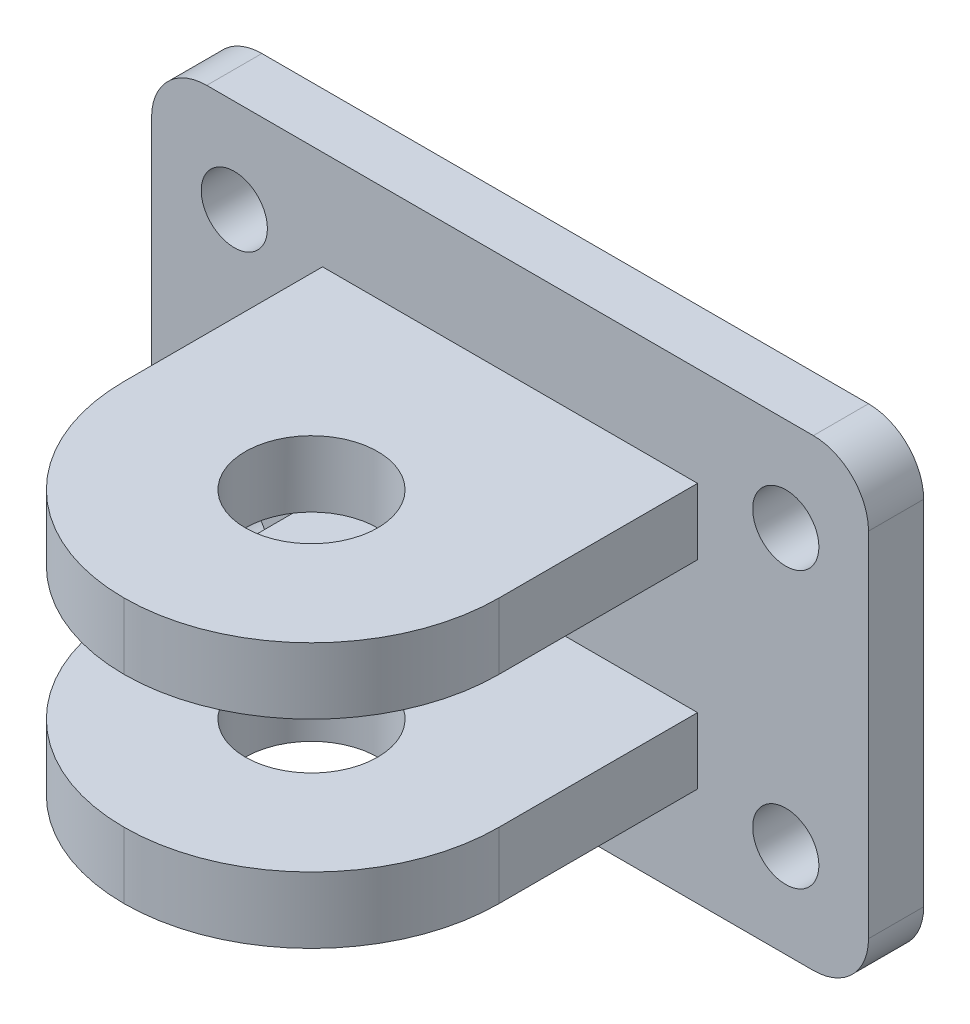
ISO-10303-21;
HEADER;
FILE_DESCRIPTION(('STEP AP214'),'2;1');
FILE_NAME('part.step','',(''),(''),'','','');
FILE_SCHEMA(('AUTOMOTIVE_DESIGN { 1 0 10303 214 1 1 1 1 }'));
ENDSEC;
DATA;
#1=APPLICATION_CONTEXT('core data for automotive mechanical design processes');
#2=APPLICATION_PROTOCOL_DEFINITION('international standard','automotive_design',2000,#1);
#3=PRODUCT_CONTEXT('',#1,'mechanical');
#4=PRODUCT('Part','Part','',(#3));
#5=PRODUCT_RELATED_PRODUCT_CATEGORY('part','',(#4));
#6=PRODUCT_DEFINITION_FORMATION('','',#4);
#7=PRODUCT_DEFINITION_CONTEXT('part definition',#1,'design');
#8=PRODUCT_DEFINITION('design','',#6,#7);
#9=PRODUCT_DEFINITION_SHAPE('','',#8);
#10=(LENGTH_UNIT() NAMED_UNIT(*) SI_UNIT(.MILLI.,.METRE.));
#11=(NAMED_UNIT(*) PLANE_ANGLE_UNIT() SI_UNIT($,.RADIAN.));
#12=(NAMED_UNIT(*) SI_UNIT($,.STERADIAN.) SOLID_ANGLE_UNIT());
#13=UNCERTAINTY_MEASURE_WITH_UNIT(LENGTH_MEASURE(1.E-05),#10,'distance_accuracy_value','');
#14=(GEOMETRIC_REPRESENTATION_CONTEXT(3) GLOBAL_UNCERTAINTY_ASSIGNED_CONTEXT((#13)) GLOBAL_UNIT_ASSIGNED_CONTEXT((#10,
#11,#12)) REPRESENTATION_CONTEXT('',''));
#15=CARTESIAN_POINT('',(0.,0.,0.));
#16=DIRECTION('',(0.,0.,1.));
#17=DIRECTION('',(1.,0.,0.));
#18=AXIS2_PLACEMENT_3D('',#15,#16,#17);
#19=CARTESIAN_POINT('',(-32.5,-21.,5.));
#20=DIRECTION('',(0.,0.,1.));
#21=DIRECTION('',(1.,0.,0.));
#22=AXIS2_PLACEMENT_3D('',#19,#20,#21);
#23=PLANE('',#22);
#24=DIRECTION('',(1.,0.,0.));
#25=VECTOR('',#24,1.);
#26=CARTESIAN_POINT('',(-17.,6.,5.));
#27=LINE('',#26,#25);
#28=CARTESIAN_POINT('',(-17.,6.,5.));
#29=VERTEX_POINT('',#28);
#30=CARTESIAN_POINT('',(17.,6.,5.));
#31=VERTEX_POINT('',#30);
#32=EDGE_CURVE('E201',#29,#31,#27,.T.);
#33=ORIENTED_EDGE('',*,*,#32,.F.);
#34=DIRECTION('',(0.,-1.,0.));
#35=VECTOR('',#34,1.);
#36=CARTESIAN_POINT('',(-17.,12.,5.));
#37=LINE('',#36,#35);
#38=CARTESIAN_POINT('',(-17.,12.,5.));
#39=VERTEX_POINT('',#38);
#40=EDGE_CURVE('E174',#39,#29,#37,.T.);
#41=ORIENTED_EDGE('',*,*,#40,.F.);
#42=DIRECTION('',(-1.,0.,0.));
#43=VECTOR('',#42,1.);
#44=CARTESIAN_POINT('',(-17.,12.,5.));
#45=LINE('',#44,#43);
#46=CARTESIAN_POINT('',(17.,12.,5.));
#47=VERTEX_POINT('',#46);
#48=EDGE_CURVE('E207',#47,#39,#45,.T.);
#49=ORIENTED_EDGE('',*,*,#48,.F.);
#50=DIRECTION('',(0.,1.,0.));
#51=VECTOR('',#50,1.);
#52=CARTESIAN_POINT('',(17.,12.,5.));
#53=LINE('',#52,#51);
#54=EDGE_CURVE('E204',#31,#47,#53,.T.);
#55=ORIENTED_EDGE('',*,*,#54,.F.);
#56=EDGE_LOOP('',(#33,#41,#49,#55));
#57=FACE_BOUND('',#56,.T.);
#58=CARTESIAN_POINT('',(25.,-12.5,5.));
#59=DIRECTION('',(0.,0.,1.));
#60=DIRECTION('',(1.,0.,0.));
#61=AXIS2_PLACEMENT_3D('',#58,#59,#60);
#62=CIRCLE('',#61,3.);
#63=CARTESIAN_POINT('',(28.,-12.5,5.));
#64=VERTEX_POINT('',#63);
#65=EDGE_CURVE('E218',#64,#64,#62,.T.);
#66=ORIENTED_EDGE('',*,*,#65,.F.);
#67=EDGE_LOOP('',(#66));
#68=FACE_BOUND('',#67,.T.);
#69=CARTESIAN_POINT('',(-25.,-12.5,5.));
#70=DIRECTION('',(0.,0.,1.));
#71=DIRECTION('',(1.,0.,0.));
#72=AXIS2_PLACEMENT_3D('',#69,#70,#71);
#73=CIRCLE('',#72,3.);
#74=CARTESIAN_POINT('',(-22.,-12.5,5.));
#75=VERTEX_POINT('',#74);
#76=EDGE_CURVE('E224',#75,#75,#73,.T.);
#77=ORIENTED_EDGE('',*,*,#76,.F.);
#78=EDGE_LOOP('',(#77));
#79=FACE_BOUND('',#78,.T.);
#80=CARTESIAN_POINT('',(-25.,12.5,5.));
#81=DIRECTION('',(0.,0.,1.));
#82=DIRECTION('',(1.,0.,0.));
#83=AXIS2_PLACEMENT_3D('',#80,#81,#82);
#84=CIRCLE('',#83,3.);
#85=CARTESIAN_POINT('',(-22.,12.5,5.));
#86=VERTEX_POINT('',#85);
#87=EDGE_CURVE('E230',#86,#86,#84,.T.);
#88=ORIENTED_EDGE('',*,*,#87,.F.);
#89=EDGE_LOOP('',(#88));
#90=FACE_BOUND('',#89,.T.);
#91=CARTESIAN_POINT('',(25.,12.5,5.));
#92=DIRECTION('',(0.,0.,1.));
#93=DIRECTION('',(1.,0.,0.));
#94=AXIS2_PLACEMENT_3D('',#91,#92,#93);
#95=CIRCLE('',#94,3.);
#96=CARTESIAN_POINT('',(28.,12.5,5.));
#97=VERTEX_POINT('',#96);
#98=EDGE_CURVE('E236',#97,#97,#95,.T.);
#99=ORIENTED_EDGE('',*,*,#98,.F.);
#100=EDGE_LOOP('',(#99));
#101=FACE_BOUND('',#100,.T.);
#102=DIRECTION('',(-1.,0.,0.));
#103=VECTOR('',#102,1.);
#104=CARTESIAN_POINT('',(-32.5,21.,5.));
#105=LINE('',#104,#103);
#106=CARTESIAN_POINT('',(27.5,21.,5.));
#107=VERTEX_POINT('',#106);
#108=CARTESIAN_POINT('',(-27.5,21.,5.));
#109=VERTEX_POINT('',#108);
#110=EDGE_CURVE('E260',#107,#109,#105,.T.);
#111=ORIENTED_EDGE('',*,*,#110,.T.);
#112=CARTESIAN_POINT('',(-27.5,16.,5.));
#113=DIRECTION('',(0.,0.,1.));
#114=DIRECTION('',(1.,0.,0.));
#115=AXIS2_PLACEMENT_3D('',#112,#113,#114);
#116=CIRCLE('',#115,5.);
#117=CARTESIAN_POINT('',(-32.5,16.,5.));
#118=VERTEX_POINT('',#117);
#119=EDGE_CURVE('E315',#109,#118,#116,.T.);
#120=ORIENTED_EDGE('',*,*,#119,.T.);
#121=DIRECTION('',(0.,-1.,0.));
#122=VECTOR('',#121,1.);
#123=CARTESIAN_POINT('',(-32.5,21.,5.));
#124=LINE('',#123,#122);
#125=CARTESIAN_POINT('',(-32.5,-16.,5.));
#126=VERTEX_POINT('',#125);
#127=EDGE_CURVE('E253',#118,#126,#124,.T.);
#128=ORIENTED_EDGE('',*,*,#127,.T.);
#129=CARTESIAN_POINT('',(-27.5,-16.,5.));
#130=DIRECTION('',(0.,0.,1.));
#131=DIRECTION('',(1.,0.,0.));
#132=AXIS2_PLACEMENT_3D('',#129,#130,#131);
#133=CIRCLE('',#132,5.);
#134=CARTESIAN_POINT('',(-27.5,-21.,5.));
#135=VERTEX_POINT('',#134);
#136=EDGE_CURVE('E310',#126,#135,#133,.T.);
#137=ORIENTED_EDGE('',*,*,#136,.T.);
#138=DIRECTION('',(1.,0.,0.));
#139=VECTOR('',#138,1.);
#140=CARTESIAN_POINT('',(-32.5,-21.,5.));
#141=LINE('',#140,#139);
#142=CARTESIAN_POINT('',(27.5,-21.,5.));
#143=VERTEX_POINT('',#142);
#144=EDGE_CURVE('E256',#135,#143,#141,.T.);
#145=ORIENTED_EDGE('',*,*,#144,.T.);
#146=CARTESIAN_POINT('',(27.5,-16.,5.));
#147=DIRECTION('',(0.,0.,1.));
#148=DIRECTION('',(1.,0.,0.));
#149=AXIS2_PLACEMENT_3D('',#146,#147,#148);
#150=CIRCLE('',#149,5.);
#151=CARTESIAN_POINT('',(32.5,-16.,5.));
#152=VERTEX_POINT('',#151);
#153=EDGE_CURVE('E58',#143,#152,#150,.T.);
#154=ORIENTED_EDGE('',*,*,#153,.T.);
#155=DIRECTION('',(0.,1.,0.));
#156=VECTOR('',#155,1.);
#157=CARTESIAN_POINT('',(32.5,21.,5.));
#158=LINE('',#157,#156);
#159=CARTESIAN_POINT('',(32.5,16.,5.));
#160=VERTEX_POINT('',#159);
#161=EDGE_CURVE('E258',#152,#160,#158,.T.);
#162=ORIENTED_EDGE('',*,*,#161,.T.);
#163=CARTESIAN_POINT('',(27.5,16.,5.));
#164=DIRECTION('',(0.,0.,1.));
#165=DIRECTION('',(1.,0.,0.));
#166=AXIS2_PLACEMENT_3D('',#163,#164,#165);
#167=CIRCLE('',#166,5.);
#168=EDGE_CURVE('E313',#160,#107,#167,.T.);
#169=ORIENTED_EDGE('',*,*,#168,.T.);
#170=EDGE_LOOP('',(#111,#120,#128,#137,#145,#154,#162,#169));
#171=FACE_BOUND('',#170,.T.);
#172=DIRECTION('',(1.,0.,0.));
#173=VECTOR('',#172,1.);
#174=CARTESIAN_POINT('',(-17.,-12.,5.));
#175=LINE('',#174,#173);
#176=CARTESIAN_POINT('',(-17.,-12.,5.));
#177=VERTEX_POINT('',#176);
#178=CARTESIAN_POINT('',(17.,-12.,5.));
#179=VERTEX_POINT('',#178);
#180=EDGE_CURVE('E167',#177,#179,#175,.T.);
#181=ORIENTED_EDGE('',*,*,#180,.F.);
#182=DIRECTION('',(0.,-1.,0.));
#183=VECTOR('',#182,1.);
#184=CARTESIAN_POINT('',(-17.,-6.,5.));
#185=LINE('',#184,#183);
#186=CARTESIAN_POINT('',(-17.,-6.,5.));
#187=VERTEX_POINT('',#186);
#188=EDGE_CURVE('E178',#187,#177,#185,.T.);
#189=ORIENTED_EDGE('',*,*,#188,.F.);
#190=DIRECTION('',(-1.,0.,0.));
#191=VECTOR('',#190,1.);
#192=CARTESIAN_POINT('',(-17.,-6.,5.));
#193=LINE('',#192,#191);
#194=CARTESIAN_POINT('',(17.,-6.,5.));
#195=VERTEX_POINT('',#194);
#196=EDGE_CURVE('E190',#195,#187,#193,.T.);
#197=ORIENTED_EDGE('',*,*,#196,.F.);
#198=DIRECTION('',(0.,1.,0.));
#199=VECTOR('',#198,1.);
#200=CARTESIAN_POINT('',(17.,-6.,5.));
#201=LINE('',#200,#199);
#202=EDGE_CURVE('E188',#179,#195,#201,.T.);
#203=ORIENTED_EDGE('',*,*,#202,.F.);
#204=EDGE_LOOP('',(#181,#189,#197,#203));
#205=FACE_BOUND('',#204,.T.);
#206=ADVANCED_FACE('F36',(#57,#68,#79,#90,#101,#171,#205),#23,.T.);
#207=CARTESIAN_POINT('',(-32.5,21.,5.));
#208=DIRECTION('',(1.,0.,0.));
#209=DIRECTION('',(0.,0.,-1.));
#210=AXIS2_PLACEMENT_3D('',#207,#208,#209);
#211=PLANE('',#210);
#212=ORIENTED_EDGE('',*,*,#127,.F.);
#213=DIRECTION('',(0.,0.,-1.));
#214=VECTOR('',#213,1.);
#215=CARTESIAN_POINT('',(-32.5,16.,5.));
#216=LINE('',#215,#214);
#217=CARTESIAN_POINT('',(-32.5,16.,0.));
#218=VERTEX_POINT('',#217);
#219=EDGE_CURVE('E294',#118,#218,#216,.T.);
#220=ORIENTED_EDGE('',*,*,#219,.T.);
#221=DIRECTION('',(0.,-1.,0.));
#222=VECTOR('',#221,1.);
#223=CARTESIAN_POINT('',(-32.5,21.,0.));
#224=LINE('',#223,#222);
#225=CARTESIAN_POINT('',(-32.5,-16.,0.));
#226=VERTEX_POINT('',#225);
#227=EDGE_CURVE('E242',#218,#226,#224,.T.);
#228=ORIENTED_EDGE('',*,*,#227,.T.);
#229=DIRECTION('',(0.,0.,-1.));
#230=VECTOR('',#229,1.);
#231=CARTESIAN_POINT('',(-32.5,-16.,5.));
#232=LINE('',#231,#230);
#233=EDGE_CURVE('E287',#226,#126,#232,.F.);
#234=ORIENTED_EDGE('',*,*,#233,.T.);
#235=EDGE_LOOP('',(#212,#220,#228,#234));
#236=FACE_BOUND('',#235,.T.);
#237=ADVANCED_FACE('F38',(#236),#211,.F.);
#238=CARTESIAN_POINT('',(-32.5,-21.,5.));
#239=DIRECTION('',(0.,1.,0.));
#240=DIRECTION('',(-1.,0.,0.));
#241=AXIS2_PLACEMENT_3D('',#238,#239,#240);
#242=PLANE('',#241);
#243=DIRECTION('',(1.,0.,0.));
#244=VECTOR('',#243,1.);
#245=CARTESIAN_POINT('',(-32.5,-21.,0.));
#246=LINE('',#245,#244);
#247=CARTESIAN_POINT('',(-27.5,-21.,0.));
#248=VERTEX_POINT('',#247);
#249=CARTESIAN_POINT('',(27.5,-21.,0.));
#250=VERTEX_POINT('',#249);
#251=EDGE_CURVE('E245',#248,#250,#246,.T.);
#252=ORIENTED_EDGE('',*,*,#251,.T.);
#253=DIRECTION('',(0.,0.,-1.));
#254=VECTOR('',#253,1.);
#255=CARTESIAN_POINT('',(27.5,-21.,5.));
#256=LINE('',#255,#254);
#257=EDGE_CURVE('E11',#250,#143,#256,.F.);
#258=ORIENTED_EDGE('',*,*,#257,.T.);
#259=ORIENTED_EDGE('',*,*,#144,.F.);
#260=DIRECTION('',(0.,0.,-1.));
#261=VECTOR('',#260,1.);
#262=CARTESIAN_POINT('',(-27.5,-21.,5.));
#263=LINE('',#262,#261);
#264=EDGE_CURVE('E44',#135,#248,#263,.T.);
#265=ORIENTED_EDGE('',*,*,#264,.T.);
#266=EDGE_LOOP('',(#252,#258,#259,#265));
#267=FACE_BOUND('',#266,.T.);
#268=ADVANCED_FACE('F325',(#267),#242,.F.);
#269=CARTESIAN_POINT('',(32.5,21.,5.));
#270=DIRECTION('',(-1.,0.,0.));
#271=DIRECTION('',(0.,0.,1.));
#272=AXIS2_PLACEMENT_3D('',#269,#270,#271);
#273=PLANE('',#272);
#274=DIRECTION('',(0.,1.,0.));
#275=VECTOR('',#274,1.);
#276=CARTESIAN_POINT('',(32.5,21.,0.));
#277=LINE('',#276,#275);
#278=CARTESIAN_POINT('',(32.5,-16.,0.));
#279=VERTEX_POINT('',#278);
#280=CARTESIAN_POINT('',(32.5,16.,0.));
#281=VERTEX_POINT('',#280);
#282=EDGE_CURVE('E248',#279,#281,#277,.T.);
#283=ORIENTED_EDGE('',*,*,#282,.T.);
#284=DIRECTION('',(0.,0.,-1.));
#285=VECTOR('',#284,1.);
#286=CARTESIAN_POINT('',(32.5,16.,5.));
#287=LINE('',#286,#285);
#288=EDGE_CURVE('E51',#281,#160,#287,.F.);
#289=ORIENTED_EDGE('',*,*,#288,.T.);
#290=ORIENTED_EDGE('',*,*,#161,.F.);
#291=DIRECTION('',(0.,0.,-1.));
#292=VECTOR('',#291,1.);
#293=CARTESIAN_POINT('',(32.5,-16.,5.));
#294=LINE('',#293,#292);
#295=EDGE_CURVE('E317',#152,#279,#294,.T.);
#296=ORIENTED_EDGE('',*,*,#295,.T.);
#297=EDGE_LOOP('',(#283,#289,#290,#296));
#298=FACE_BOUND('',#297,.T.);
#299=ADVANCED_FACE('F336',(#298),#273,.F.);
#300=CARTESIAN_POINT('',(-32.5,21.,5.));
#301=DIRECTION('',(0.,-1.,0.));
#302=DIRECTION('',(1.,0.,0.));
#303=AXIS2_PLACEMENT_3D('',#300,#301,#302);
#304=PLANE('',#303);
#305=DIRECTION('',(-1.,0.,0.));
#306=VECTOR('',#305,1.);
#307=CARTESIAN_POINT('',(-32.5,21.,0.));
#308=LINE('',#307,#306);
#309=CARTESIAN_POINT('',(27.5,21.,0.));
#310=VERTEX_POINT('',#309);
#311=CARTESIAN_POINT('',(-27.5,21.,0.));
#312=VERTEX_POINT('',#311);
#313=EDGE_CURVE('E250',#310,#312,#308,.T.);
#314=ORIENTED_EDGE('',*,*,#313,.T.);
#315=DIRECTION('',(0.,0.,-1.));
#316=VECTOR('',#315,1.);
#317=CARTESIAN_POINT('',(-27.5,21.,5.));
#318=LINE('',#317,#316);
#319=EDGE_CURVE('E308',#312,#109,#318,.F.);
#320=ORIENTED_EDGE('',*,*,#319,.T.);
#321=ORIENTED_EDGE('',*,*,#110,.F.);
#322=DIRECTION('',(0.,0.,-1.));
#323=VECTOR('',#322,1.);
#324=CARTESIAN_POINT('',(27.5,21.,5.));
#325=LINE('',#324,#323);
#326=EDGE_CURVE('E305',#107,#310,#325,.T.);
#327=ORIENTED_EDGE('',*,*,#326,.T.);
#328=EDGE_LOOP('',(#314,#320,#321,#327));
#329=FACE_BOUND('',#328,.T.);
#330=ADVANCED_FACE('F344',(#329),#304,.F.);
#331=CARTESIAN_POINT('',(-32.5,-21.,0.));
#332=DIRECTION('',(0.,0.,1.));
#333=DIRECTION('',(1.,0.,0.));
#334=AXIS2_PLACEMENT_3D('',#331,#332,#333);
#335=PLANE('',#334);
#336=CARTESIAN_POINT('',(25.,-12.5,0.));
#337=DIRECTION('',(0.,0.,1.));
#338=DIRECTION('',(1.,0.,0.));
#339=AXIS2_PLACEMENT_3D('',#336,#337,#338);
#340=CIRCLE('',#339,3.);
#341=CARTESIAN_POINT('',(28.,-12.5,0.));
#342=VERTEX_POINT('',#341);
#343=EDGE_CURVE('E221',#342,#342,#340,.T.);
#344=ORIENTED_EDGE('',*,*,#343,.T.);
#345=EDGE_LOOP('',(#344));
#346=FACE_BOUND('',#345,.T.);
#347=CARTESIAN_POINT('',(-25.,-12.5,0.));
#348=DIRECTION('',(0.,0.,1.));
#349=DIRECTION('',(1.,0.,0.));
#350=AXIS2_PLACEMENT_3D('',#347,#348,#349);
#351=CIRCLE('',#350,3.);
#352=CARTESIAN_POINT('',(-22.,-12.5,0.));
#353=VERTEX_POINT('',#352);
#354=EDGE_CURVE('E227',#353,#353,#351,.T.);
#355=ORIENTED_EDGE('',*,*,#354,.T.);
#356=EDGE_LOOP('',(#355));
#357=FACE_BOUND('',#356,.T.);
#358=CARTESIAN_POINT('',(-25.,12.5,0.));
#359=DIRECTION('',(0.,0.,1.));
#360=DIRECTION('',(1.,0.,0.));
#361=AXIS2_PLACEMENT_3D('',#358,#359,#360);
#362=CIRCLE('',#361,3.);
#363=CARTESIAN_POINT('',(-22.,12.5,0.));
#364=VERTEX_POINT('',#363);
#365=EDGE_CURVE('E233',#364,#364,#362,.T.);
#366=ORIENTED_EDGE('',*,*,#365,.T.);
#367=EDGE_LOOP('',(#366));
#368=FACE_BOUND('',#367,.T.);
#369=CARTESIAN_POINT('',(25.,12.5,0.));
#370=DIRECTION('',(0.,0.,1.));
#371=DIRECTION('',(1.,0.,0.));
#372=AXIS2_PLACEMENT_3D('',#369,#370,#371);
#373=CIRCLE('',#372,3.);
#374=CARTESIAN_POINT('',(28.,12.5,0.));
#375=VERTEX_POINT('',#374);
#376=EDGE_CURVE('E239',#375,#375,#373,.T.);
#377=ORIENTED_EDGE('',*,*,#376,.T.);
#378=EDGE_LOOP('',(#377));
#379=FACE_BOUND('',#378,.T.);
#380=ORIENTED_EDGE('',*,*,#227,.F.);
#381=CARTESIAN_POINT('',(-27.5,16.,0.));
#382=DIRECTION('',(0.,0.,1.));
#383=DIRECTION('',(1.,0.,0.));
#384=AXIS2_PLACEMENT_3D('',#381,#382,#383);
#385=CIRCLE('',#384,5.);
#386=EDGE_CURVE('E303',#218,#312,#385,.F.);
#387=ORIENTED_EDGE('',*,*,#386,.T.);
#388=ORIENTED_EDGE('',*,*,#313,.F.);
#389=CARTESIAN_POINT('',(27.5,16.,0.));
#390=DIRECTION('',(0.,0.,1.));
#391=DIRECTION('',(1.,0.,0.));
#392=AXIS2_PLACEMENT_3D('',#389,#390,#391);
#393=CIRCLE('',#392,5.);
#394=EDGE_CURVE('E301',#310,#281,#393,.F.);
#395=ORIENTED_EDGE('',*,*,#394,.T.);
#396=ORIENTED_EDGE('',*,*,#282,.F.);
#397=CARTESIAN_POINT('',(27.5,-16.,0.));
#398=DIRECTION('',(0.,0.,1.));
#399=DIRECTION('',(1.,0.,0.));
#400=AXIS2_PLACEMENT_3D('',#397,#398,#399);
#401=CIRCLE('',#400,5.);
#402=EDGE_CURVE('E299',#279,#250,#401,.F.);
#403=ORIENTED_EDGE('',*,*,#402,.T.);
#404=ORIENTED_EDGE('',*,*,#251,.F.);
#405=CARTESIAN_POINT('',(-27.5,-16.,0.));
#406=DIRECTION('',(0.,0.,1.));
#407=DIRECTION('',(1.,0.,0.));
#408=AXIS2_PLACEMENT_3D('',#405,#406,#407);
#409=CIRCLE('',#408,5.);
#410=EDGE_CURVE('E297',#248,#226,#409,.F.);
#411=ORIENTED_EDGE('',*,*,#410,.T.);
#412=EDGE_LOOP('',(#380,#387,#388,#395,#396,#403,#404,#411));
#413=FACE_BOUND('',#412,.T.);
#414=ADVANCED_FACE('F331',(#346,#357,#368,#379,#413),#335,.F.);
#415=CARTESIAN_POINT('',(25.,12.5,0.));
#416=DIRECTION('',(0.,0.,1.));
#417=DIRECTION('',(1.,0.,0.));
#418=AXIS2_PLACEMENT_3D('',#415,#416,#417);
#419=CYLINDRICAL_SURFACE('',#418,3.);
#420=ORIENTED_EDGE('',*,*,#376,.F.);
#421=EDGE_LOOP('',(#420));
#422=FACE_BOUND('',#421,.T.);
#423=ORIENTED_EDGE('',*,*,#98,.T.);
#424=EDGE_LOOP('',(#423));
#425=FACE_BOUND('',#424,.T.);
#426=ADVANCED_FACE('F393',(#422,#425),#419,.F.);
#427=CARTESIAN_POINT('',(-25.,12.5,0.));
#428=DIRECTION('',(0.,0.,1.));
#429=DIRECTION('',(1.,0.,0.));
#430=AXIS2_PLACEMENT_3D('',#427,#428,#429);
#431=CYLINDRICAL_SURFACE('',#430,3.);
#432=ORIENTED_EDGE('',*,*,#365,.F.);
#433=EDGE_LOOP('',(#432));
#434=FACE_BOUND('',#433,.T.);
#435=ORIENTED_EDGE('',*,*,#87,.T.);
#436=EDGE_LOOP('',(#435));
#437=FACE_BOUND('',#436,.T.);
#438=ADVANCED_FACE('F401',(#434,#437),#431,.F.);
#439=CARTESIAN_POINT('',(-25.,-12.5,0.));
#440=DIRECTION('',(0.,0.,1.));
#441=DIRECTION('',(1.,0.,0.));
#442=AXIS2_PLACEMENT_3D('',#439,#440,#441);
#443=CYLINDRICAL_SURFACE('',#442,3.);
#444=ORIENTED_EDGE('',*,*,#354,.F.);
#445=EDGE_LOOP('',(#444));
#446=FACE_BOUND('',#445,.T.);
#447=ORIENTED_EDGE('',*,*,#76,.T.);
#448=EDGE_LOOP('',(#447));
#449=FACE_BOUND('',#448,.T.);
#450=ADVANCED_FACE('F408',(#446,#449),#443,.F.);
#451=CARTESIAN_POINT('',(25.,-12.5,0.));
#452=DIRECTION('',(0.,0.,1.));
#453=DIRECTION('',(1.,0.,0.));
#454=AXIS2_PLACEMENT_3D('',#451,#452,#453);
#455=CYLINDRICAL_SURFACE('',#454,3.);
#456=ORIENTED_EDGE('',*,*,#343,.F.);
#457=EDGE_LOOP('',(#456));
#458=FACE_BOUND('',#457,.T.);
#459=ORIENTED_EDGE('',*,*,#65,.T.);
#460=EDGE_LOOP('',(#459));
#461=FACE_BOUND('',#460,.T.);
#462=ADVANCED_FACE('F416',(#458,#461),#455,.F.);
#463=CARTESIAN_POINT('',(-17.,12.,40.));
#464=DIRECTION('',(1.,0.,0.));
#465=DIRECTION('',(0.,1.,0.));
#466=AXIS2_PLACEMENT_3D('',#463,#464,#465);
#467=PLANE('',#466);
#468=DIRECTION('',(0.,0.,-1.));
#469=VECTOR('',#468,1.);
#470=CARTESIAN_POINT('',(-17.,6.,40.));
#471=LINE('',#470,#469);
#472=CARTESIAN_POINT('',(-17.,6.,23.));
#473=VERTEX_POINT('',#472);
#474=EDGE_CURVE('E216',#473,#29,#471,.T.);
#475=ORIENTED_EDGE('',*,*,#474,.F.);
#476=DIRECTION('',(0.,-1.,0.));
#477=VECTOR('',#476,1.);
#478=CARTESIAN_POINT('',(-17.,12.,23.));
#479=LINE('',#478,#477);
#480=CARTESIAN_POINT('',(-17.,12.,23.));
#481=VERTEX_POINT('',#480);
#482=EDGE_CURVE('E267',#473,#481,#479,.F.);
#483=ORIENTED_EDGE('',*,*,#482,.T.);
#484=DIRECTION('',(0.,0.,-1.));
#485=VECTOR('',#484,1.);
#486=CARTESIAN_POINT('',(-17.,12.,40.));
#487=LINE('',#486,#485);
#488=EDGE_CURVE('E210',#481,#39,#487,.T.);
#489=ORIENTED_EDGE('',*,*,#488,.T.);
#490=ORIENTED_EDGE('',*,*,#40,.T.);
#491=EDGE_LOOP('',(#475,#483,#489,#490));
#492=FACE_BOUND('',#491,.T.);
#493=ADVANCED_FACE('F424',(#492),#467,.F.);
#494=CARTESIAN_POINT('',(-17.,6.,40.));
#495=DIRECTION('',(0.,1.,0.));
#496=DIRECTION('',(-1.,0.,0.));
#497=AXIS2_PLACEMENT_3D('',#494,#495,#496);
#498=PLANE('',#497);
#499=CARTESIAN_POINT('',(0.,6.,23.));
#500=DIRECTION('',(0.,1.,0.));
#501=DIRECTION('',(-1.,0.,0.));
#502=AXIS2_PLACEMENT_3D('',#499,#500,#501);
#503=CIRCLE('',#502,6.);
#504=CARTESIAN_POINT('',(-5.99999999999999,6.,23.));
#505=VERTEX_POINT('',#504);
#506=EDGE_CURVE('E617',#505,#505,#503,.T.);
#507=ORIENTED_EDGE('',*,*,#506,.T.);
#508=EDGE_LOOP('',(#507));
#509=FACE_BOUND('',#508,.T.);
#510=CARTESIAN_POINT('',(0.,6.,23.));
#511=DIRECTION('',(0.,1.,0.));
#512=DIRECTION('',(-1.,0.,0.));
#513=AXIS2_PLACEMENT_3D('',#510,#511,#512);
#514=CIRCLE('',#513,17.);
#515=CARTESIAN_POINT('',(17.,6.,23.));
#516=VERTEX_POINT('',#515);
#517=CARTESIAN_POINT('',(0.,6.,40.));
#518=VERTEX_POINT('',#517);
#519=EDGE_CURVE('E263',#516,#518,#514,.F.);
#520=ORIENTED_EDGE('',*,*,#519,.T.);
#521=CARTESIAN_POINT('',(0.,6.,23.));
#522=DIRECTION('',(0.,1.,0.));
#523=DIRECTION('',(-1.,0.,0.));
#524=AXIS2_PLACEMENT_3D('',#521,#522,#523);
#525=CIRCLE('',#524,17.);
#526=EDGE_CURVE('E265',#518,#473,#525,.F.);
#527=ORIENTED_EDGE('',*,*,#526,.T.);
#528=ORIENTED_EDGE('',*,*,#474,.T.);
#529=ORIENTED_EDGE('',*,*,#32,.T.);
#530=DIRECTION('',(0.,0.,-1.));
#531=VECTOR('',#530,1.);
#532=CARTESIAN_POINT('',(17.,6.,40.));
#533=LINE('',#532,#531);
#534=EDGE_CURVE('E214',#516,#31,#533,.T.);
#535=ORIENTED_EDGE('',*,*,#534,.F.);
#536=EDGE_LOOP('',(#520,#527,#528,#529,#535));
#537=FACE_BOUND('',#536,.T.);
#538=ADVANCED_FACE('F432',(#509,#537),#498,.F.);
#539=CARTESIAN_POINT('',(17.,12.,40.));
#540=DIRECTION('',(-1.,0.,0.));
#541=DIRECTION('',(0.,-1.,0.));
#542=AXIS2_PLACEMENT_3D('',#539,#540,#541);
#543=PLANE('',#542);
#544=DIRECTION('',(0.,0.,-1.));
#545=VECTOR('',#544,1.);
#546=CARTESIAN_POINT('',(17.,12.,40.));
#547=LINE('',#546,#545);
#548=CARTESIAN_POINT('',(17.,12.,23.));
#549=VERTEX_POINT('',#548);
#550=EDGE_CURVE('E212',#549,#47,#547,.T.);
#551=ORIENTED_EDGE('',*,*,#550,.F.);
#552=DIRECTION('',(0.,1.,0.));
#553=VECTOR('',#552,1.);
#554=CARTESIAN_POINT('',(17.,6.,23.));
#555=LINE('',#554,#553);
#556=EDGE_CURVE('E285',#549,#516,#555,.F.);
#557=ORIENTED_EDGE('',*,*,#556,.T.);
#558=ORIENTED_EDGE('',*,*,#534,.T.);
#559=ORIENTED_EDGE('',*,*,#54,.T.);
#560=EDGE_LOOP('',(#551,#557,#558,#559));
#561=FACE_BOUND('',#560,.T.);
#562=ADVANCED_FACE('F441',(#561),#543,.F.);
#563=CARTESIAN_POINT('',(-17.,12.,40.));
#564=DIRECTION('',(0.,-1.,0.));
#565=DIRECTION('',(0.,0.,-1.));
#566=AXIS2_PLACEMENT_3D('',#563,#564,#565);
#567=PLANE('',#566);
#568=CARTESIAN_POINT('',(0.,12.,23.));
#569=DIRECTION('',(0.,1.,0.));
#570=DIRECTION('',(0.,0.,1.));
#571=AXIS2_PLACEMENT_3D('',#568,#569,#570);
#572=CIRCLE('',#571,6.);
#573=CARTESIAN_POINT('',(0.,12.,29.));
#574=VERTEX_POINT('',#573);
#575=EDGE_CURVE('E292',#574,#574,#572,.T.);
#576=ORIENTED_EDGE('',*,*,#575,.F.);
#577=EDGE_LOOP('',(#576));
#578=FACE_BOUND('',#577,.T.);
#579=ORIENTED_EDGE('',*,*,#488,.F.);
#580=CARTESIAN_POINT('',(0.,12.,23.));
#581=DIRECTION('',(0.,-1.,0.));
#582=DIRECTION('',(0.,0.,-1.));
#583=AXIS2_PLACEMENT_3D('',#580,#581,#582);
#584=CIRCLE('',#583,17.);
#585=CARTESIAN_POINT('',(0.,12.,40.));
#586=VERTEX_POINT('',#585);
#587=EDGE_CURVE('E272',#481,#586,#584,.F.);
#588=ORIENTED_EDGE('',*,*,#587,.T.);
#589=CARTESIAN_POINT('',(0.,12.,23.));
#590=DIRECTION('',(0.,-1.,0.));
#591=DIRECTION('',(0.,0.,-1.));
#592=AXIS2_PLACEMENT_3D('',#589,#590,#591);
#593=CIRCLE('',#592,17.);
#594=EDGE_CURVE('E270',#586,#549,#593,.F.);
#595=ORIENTED_EDGE('',*,*,#594,.T.);
#596=ORIENTED_EDGE('',*,*,#550,.T.);
#597=ORIENTED_EDGE('',*,*,#48,.T.);
#598=EDGE_LOOP('',(#579,#588,#595,#596,#597));
#599=FACE_BOUND('',#598,.T.);
#600=ADVANCED_FACE('F450',(#578,#599),#567,.F.);
#601=CARTESIAN_POINT('',(-17.,-6.,40.));
#602=DIRECTION('',(1.,0.,0.));
#603=DIRECTION('',(0.,1.,0.));
#604=AXIS2_PLACEMENT_3D('',#601,#602,#603);
#605=PLANE('',#604);
#606=DIRECTION('',(0.,0.,-1.));
#607=VECTOR('',#606,1.);
#608=CARTESIAN_POINT('',(-17.,-12.,40.));
#609=LINE('',#608,#607);
#610=CARTESIAN_POINT('',(-17.,-12.,23.));
#611=VERTEX_POINT('',#610);
#612=EDGE_CURVE('E162',#611,#177,#609,.T.);
#613=ORIENTED_EDGE('',*,*,#612,.F.);
#614=DIRECTION('',(0.,-1.,0.));
#615=VECTOR('',#614,1.);
#616=CARTESIAN_POINT('',(-17.,-6.,23.));
#617=LINE('',#616,#615);
#618=CARTESIAN_POINT('',(-17.,-6.,23.));
#619=VERTEX_POINT('',#618);
#620=EDGE_CURVE('E277',#611,#619,#617,.F.);
#621=ORIENTED_EDGE('',*,*,#620,.T.);
#622=DIRECTION('',(0.,0.,-1.));
#623=VECTOR('',#622,1.);
#624=CARTESIAN_POINT('',(-17.,-6.,40.));
#625=LINE('',#624,#623);
#626=EDGE_CURVE('E181',#619,#187,#625,.T.);
#627=ORIENTED_EDGE('',*,*,#626,.T.);
#628=ORIENTED_EDGE('',*,*,#188,.T.);
#629=EDGE_LOOP('',(#613,#621,#627,#628));
#630=FACE_BOUND('',#629,.T.);
#631=ADVANCED_FACE('F179',(#630),#605,.F.);
#632=CARTESIAN_POINT('',(-17.,-12.,40.));
#633=DIRECTION('',(0.,1.,0.));
#634=DIRECTION('',(0.,0.,1.));
#635=AXIS2_PLACEMENT_3D('',#632,#633,#634);
#636=PLANE('',#635);
#637=CARTESIAN_POINT('',(0.,-12.,23.));
#638=DIRECTION('',(0.,1.,0.));
#639=DIRECTION('',(0.,0.,1.));
#640=AXIS2_PLACEMENT_3D('',#637,#638,#639);
#641=CIRCLE('',#640,6.);
#642=CARTESIAN_POINT('',(0.,-12.,29.));
#643=VERTEX_POINT('',#642);
#644=EDGE_CURVE('E291',#643,#643,#641,.T.);
#645=ORIENTED_EDGE('',*,*,#644,.T.);
#646=EDGE_LOOP('',(#645));
#647=FACE_BOUND('',#646,.T.);
#648=CARTESIAN_POINT('',(0.,-12.,23.));
#649=DIRECTION('',(0.,1.,0.));
#650=DIRECTION('',(0.,0.,1.));
#651=AXIS2_PLACEMENT_3D('',#648,#649,#650);
#652=CIRCLE('',#651,17.);
#653=CARTESIAN_POINT('',(17.,-12.,23.));
#654=VERTEX_POINT('',#653);
#655=CARTESIAN_POINT('',(0.,-12.,40.));
#656=VERTEX_POINT('',#655);
#657=EDGE_CURVE('E274',#654,#656,#652,.F.);
#658=ORIENTED_EDGE('',*,*,#657,.T.);
#659=CARTESIAN_POINT('',(0.,-12.,23.));
#660=DIRECTION('',(0.,1.,0.));
#661=DIRECTION('',(0.,0.,1.));
#662=AXIS2_PLACEMENT_3D('',#659,#660,#661);
#663=CIRCLE('',#662,17.);
#664=EDGE_CURVE('E170',#656,#611,#663,.F.);
#665=ORIENTED_EDGE('',*,*,#664,.T.);
#666=ORIENTED_EDGE('',*,*,#612,.T.);
#667=ORIENTED_EDGE('',*,*,#180,.T.);
#668=DIRECTION('',(0.,0.,-1.));
#669=VECTOR('',#668,1.);
#670=CARTESIAN_POINT('',(17.,-12.,40.));
#671=LINE('',#670,#669);
#672=EDGE_CURVE('E175',#654,#179,#671,.T.);
#673=ORIENTED_EDGE('',*,*,#672,.F.);
#674=EDGE_LOOP('',(#658,#665,#666,#667,#673));
#675=FACE_BOUND('',#674,.T.);
#676=ADVANCED_FACE('F164',(#647,#675),#636,.F.);
#677=CARTESIAN_POINT('',(17.,-6.,40.));
#678=DIRECTION('',(-1.,0.,0.));
#679=DIRECTION('',(0.,-1.,0.));
#680=AXIS2_PLACEMENT_3D('',#677,#678,#679);
#681=PLANE('',#680);
#682=DIRECTION('',(0.,0.,-1.));
#683=VECTOR('',#682,1.);
#684=CARTESIAN_POINT('',(17.,-6.,40.));
#685=LINE('',#684,#683);
#686=CARTESIAN_POINT('',(17.,-6.,23.));
#687=VERTEX_POINT('',#686);
#688=EDGE_CURVE('E196',#687,#195,#685,.T.);
#689=ORIENTED_EDGE('',*,*,#688,.F.);
#690=DIRECTION('',(0.,1.,0.));
#691=VECTOR('',#690,1.);
#692=CARTESIAN_POINT('',(17.,-12.,23.));
#693=LINE('',#692,#691);
#694=EDGE_CURVE('E283',#687,#654,#693,.F.);
#695=ORIENTED_EDGE('',*,*,#694,.T.);
#696=ORIENTED_EDGE('',*,*,#672,.T.);
#697=ORIENTED_EDGE('',*,*,#202,.T.);
#698=EDGE_LOOP('',(#689,#695,#696,#697));
#699=FACE_BOUND('',#698,.T.);
#700=ADVANCED_FACE('F471',(#699),#681,.F.);
#701=CARTESIAN_POINT('',(-17.,-6.,40.));
#702=DIRECTION('',(0.,-1.,0.));
#703=DIRECTION('',(1.,0.,0.));
#704=AXIS2_PLACEMENT_3D('',#701,#702,#703);
#705=PLANE('',#704);
#706=CARTESIAN_POINT('',(0.,-6.,23.));
#707=DIRECTION('',(0.,-1.,0.));
#708=DIRECTION('',(1.,0.,0.));
#709=AXIS2_PLACEMENT_3D('',#706,#707,#708);
#710=CIRCLE('',#709,6.);
#711=CARTESIAN_POINT('',(6.00000000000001,-6.,23.));
#712=VERTEX_POINT('',#711);
#713=EDGE_CURVE('E288',#712,#712,#710,.T.);
#714=ORIENTED_EDGE('',*,*,#713,.T.);
#715=EDGE_LOOP('',(#714));
#716=FACE_BOUND('',#715,.T.);
#717=ORIENTED_EDGE('',*,*,#626,.F.);
#718=CARTESIAN_POINT('',(0.,-6.,23.));
#719=DIRECTION('',(0.,-1.,0.));
#720=DIRECTION('',(1.,0.,0.));
#721=AXIS2_PLACEMENT_3D('',#718,#719,#720);
#722=CIRCLE('',#721,17.);
#723=CARTESIAN_POINT('',(0.,-6.,40.));
#724=VERTEX_POINT('',#723);
#725=EDGE_CURVE('E281',#619,#724,#722,.F.);
#726=ORIENTED_EDGE('',*,*,#725,.T.);
#727=CARTESIAN_POINT('',(0.,-6.,23.));
#728=DIRECTION('',(0.,-1.,0.));
#729=DIRECTION('',(1.,0.,0.));
#730=AXIS2_PLACEMENT_3D('',#727,#728,#729);
#731=CIRCLE('',#730,17.);
#732=EDGE_CURVE('E279',#724,#687,#731,.F.);
#733=ORIENTED_EDGE('',*,*,#732,.T.);
#734=ORIENTED_EDGE('',*,*,#688,.T.);
#735=ORIENTED_EDGE('',*,*,#196,.T.);
#736=EDGE_LOOP('',(#717,#726,#733,#734,#735));
#737=FACE_BOUND('',#736,.T.);
#738=ADVANCED_FACE('F479',(#716,#737),#705,.F.);
#739=CARTESIAN_POINT('',(0.,6.00000000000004,23.));
#740=DIRECTION('',(0.,-1.,0.));
#741=DIRECTION('',(1.,0.,0.));
#742=AXIS2_PLACEMENT_3D('',#739,#740,#741);
#743=CYLINDRICAL_SURFACE('',#742,17.);
#744=ORIENTED_EDGE('',*,*,#556,.F.);
#745=ORIENTED_EDGE('',*,*,#594,.F.);
#746=DIRECTION('',(0.,1.,0.));
#747=VECTOR('',#746,1.);
#748=CARTESIAN_POINT('',(0.,12.,40.));
#749=LINE('',#748,#747);
#750=EDGE_CURVE('E185',#518,#586,#749,.T.);
#751=ORIENTED_EDGE('',*,*,#750,.F.);
#752=ORIENTED_EDGE('',*,*,#519,.F.);
#753=EDGE_LOOP('',(#744,#745,#751,#752));
#754=FACE_BOUND('',#753,.T.);
#755=ADVANCED_FACE('F487',(#754),#743,.T.);
#756=CARTESIAN_POINT('',(0.,5.99999999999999,23.));
#757=DIRECTION('',(0.,1.,0.));
#758=DIRECTION('',(-1.,0.,0.));
#759=AXIS2_PLACEMENT_3D('',#756,#757,#758);
#760=CYLINDRICAL_SURFACE('',#759,17.);
#761=ORIENTED_EDGE('',*,*,#587,.F.);
#762=ORIENTED_EDGE('',*,*,#482,.F.);
#763=ORIENTED_EDGE('',*,*,#526,.F.);
#764=ORIENTED_EDGE('',*,*,#750,.T.);
#765=EDGE_LOOP('',(#761,#762,#763,#764));
#766=FACE_BOUND('',#765,.T.);
#767=ADVANCED_FACE('F495',(#766),#760,.T.);
#768=CARTESIAN_POINT('',(0.,-6.00000000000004,23.));
#769=DIRECTION('',(0.,-1.,0.));
#770=DIRECTION('',(1.,0.,0.));
#771=AXIS2_PLACEMENT_3D('',#768,#769,#770);
#772=CYLINDRICAL_SURFACE('',#771,17.);
#773=ORIENTED_EDGE('',*,*,#694,.F.);
#774=ORIENTED_EDGE('',*,*,#732,.F.);
#775=DIRECTION('',(0.,1.,0.));
#776=VECTOR('',#775,1.);
#777=CARTESIAN_POINT('',(0.,-5.99999999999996,40.));
#778=LINE('',#777,#776);
#779=EDGE_CURVE('E618',#656,#724,#778,.T.);
#780=ORIENTED_EDGE('',*,*,#779,.F.);
#781=ORIENTED_EDGE('',*,*,#657,.F.);
#782=EDGE_LOOP('',(#773,#774,#780,#781));
#783=FACE_BOUND('',#782,.T.);
#784=ADVANCED_FACE('F503',(#783),#772,.T.);
#785=CARTESIAN_POINT('',(0.,-5.99999999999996,23.));
#786=DIRECTION('',(0.,1.,0.));
#787=DIRECTION('',(-1.,0.,0.));
#788=AXIS2_PLACEMENT_3D('',#785,#786,#787);
#789=CYLINDRICAL_SURFACE('',#788,17.);
#790=ORIENTED_EDGE('',*,*,#725,.F.);
#791=ORIENTED_EDGE('',*,*,#620,.F.);
#792=ORIENTED_EDGE('',*,*,#664,.F.);
#793=ORIENTED_EDGE('',*,*,#779,.T.);
#794=EDGE_LOOP('',(#790,#791,#792,#793));
#795=FACE_BOUND('',#794,.T.);
#796=ADVANCED_FACE('F511',(#795),#789,.T.);
#797=CARTESIAN_POINT('',(0.,-21.,23.));
#798=DIRECTION('',(0.,1.,0.));
#799=DIRECTION('',(0.,0.,1.));
#800=AXIS2_PLACEMENT_3D('',#797,#798,#799);
#801=CYLINDRICAL_SURFACE('',#800,6.);
#802=ORIENTED_EDGE('',*,*,#713,.F.);
#803=EDGE_LOOP('',(#802));
#804=FACE_BOUND('',#803,.T.);
#805=ORIENTED_EDGE('',*,*,#644,.F.);
#806=EDGE_LOOP('',(#805));
#807=FACE_BOUND('',#806,.T.);
#808=ADVANCED_FACE('F518',(#804,#807),#801,.F.);
#809=ORIENTED_EDGE('',*,*,#575,.T.);
#810=EDGE_LOOP('',(#809));
#811=FACE_BOUND('',#810,.T.);
#812=ORIENTED_EDGE('',*,*,#506,.F.);
#813=EDGE_LOOP('',(#812));
#814=FACE_BOUND('',#813,.T.);
#815=ADVANCED_FACE('F525',(#811,#814),#801,.F.);
#816=CARTESIAN_POINT('',(-27.5,16.,5.));
#817=DIRECTION('',(0.,0.,-1.));
#818=DIRECTION('',(-1.,0.,0.));
#819=AXIS2_PLACEMENT_3D('',#816,#817,#818);
#820=CYLINDRICAL_SURFACE('',#819,5.);
#821=ORIENTED_EDGE('',*,*,#119,.F.);
#822=ORIENTED_EDGE('',*,*,#319,.F.);
#823=ORIENTED_EDGE('',*,*,#386,.F.);
#824=ORIENTED_EDGE('',*,*,#219,.F.);
#825=EDGE_LOOP('',(#821,#822,#823,#824));
#826=FACE_BOUND('',#825,.T.);
#827=ADVANCED_FACE('F349',(#826),#820,.T.);
#828=CARTESIAN_POINT('',(27.5,16.,5.));
#829=DIRECTION('',(0.,0.,-1.));
#830=DIRECTION('',(-1.,0.,0.));
#831=AXIS2_PLACEMENT_3D('',#828,#829,#830);
#832=CYLINDRICAL_SURFACE('',#831,5.);
#833=ORIENTED_EDGE('',*,*,#168,.F.);
#834=ORIENTED_EDGE('',*,*,#288,.F.);
#835=ORIENTED_EDGE('',*,*,#394,.F.);
#836=ORIENTED_EDGE('',*,*,#326,.F.);
#837=EDGE_LOOP('',(#833,#834,#835,#836));
#838=FACE_BOUND('',#837,.T.);
#839=ADVANCED_FACE('F341',(#838),#832,.T.);
#840=CARTESIAN_POINT('',(27.5,-16.,5.));
#841=DIRECTION('',(0.,0.,-1.));
#842=DIRECTION('',(-1.,0.,0.));
#843=AXIS2_PLACEMENT_3D('',#840,#841,#842);
#844=CYLINDRICAL_SURFACE('',#843,5.);
#845=ORIENTED_EDGE('',*,*,#153,.F.);
#846=ORIENTED_EDGE('',*,*,#257,.F.);
#847=ORIENTED_EDGE('',*,*,#402,.F.);
#848=ORIENTED_EDGE('',*,*,#295,.F.);
#849=EDGE_LOOP('',(#845,#846,#847,#848));
#850=FACE_BOUND('',#849,.T.);
#851=ADVANCED_FACE('F335',(#850),#844,.T.);
#852=CARTESIAN_POINT('',(-27.5,-16.,5.));
#853=DIRECTION('',(0.,0.,-1.));
#854=DIRECTION('',(-1.,0.,0.));
#855=AXIS2_PLACEMENT_3D('',#852,#853,#854);
#856=CYLINDRICAL_SURFACE('',#855,5.);
#857=ORIENTED_EDGE('',*,*,#136,.F.);
#858=ORIENTED_EDGE('',*,*,#233,.F.);
#859=ORIENTED_EDGE('',*,*,#410,.F.);
#860=ORIENTED_EDGE('',*,*,#264,.F.);
#861=EDGE_LOOP('',(#857,#858,#859,#860));
#862=FACE_BOUND('',#861,.T.);
#863=ADVANCED_FACE('F353',(#862),#856,.T.);
#864=CLOSED_SHELL('',(#206,#237,#268,#299,#330,#414,#426,#438,#450,#462,#493,#538,#562,#600,
#631,#676,#700,#738,#755,#767,#784,#796,#808,#815,#827,#839,#851,#863));
#865=MANIFOLD_SOLID_BREP('B2',#864);
#866=ADVANCED_BREP_SHAPE_REPRESENTATION('',(#18,#865),#14);
#867=SHAPE_DEFINITION_REPRESENTATION(#9,#866);
ENDSEC;
END-ISO-10303-21;
